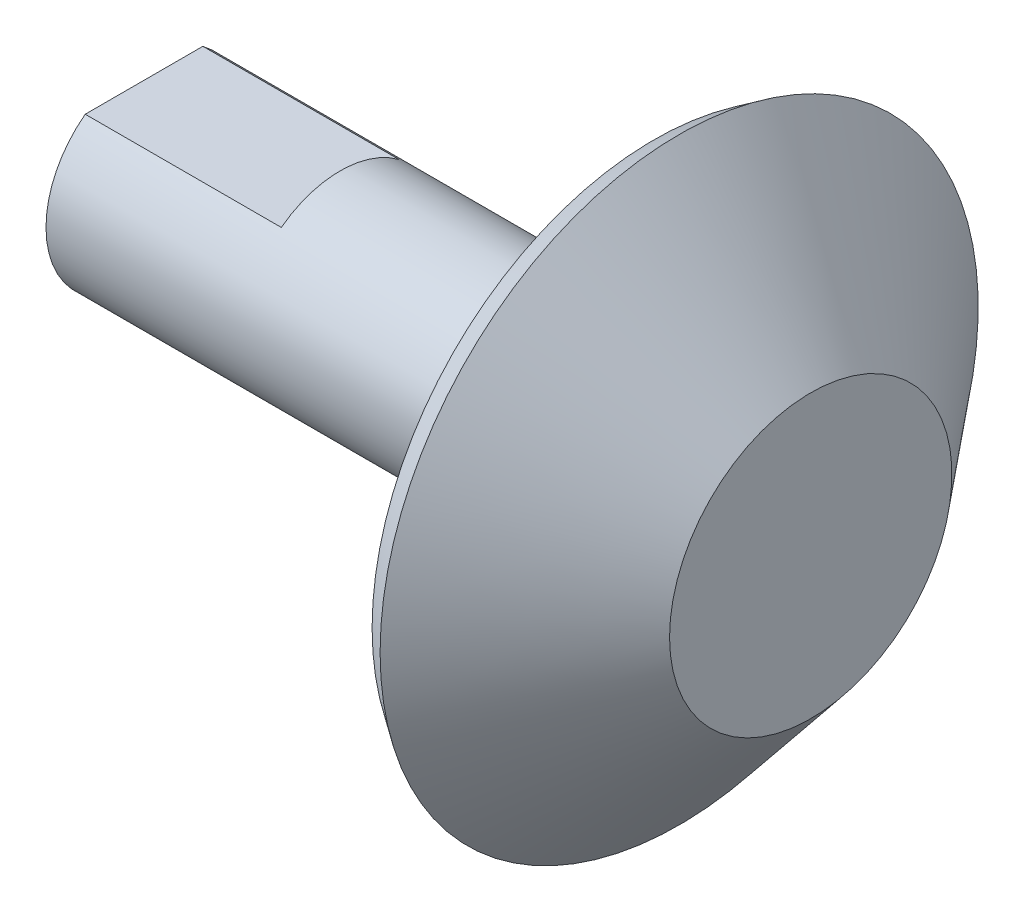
from build123d import *

# Parameters (mm, degrees)
ESQUISSE5_W             = 6.403947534
ESQUISSE5_H             = 1.660282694
ENL_V_MAT_EXTRU_2_DEPTH = 5


with BuildPart() as part:
    # Esquisse4 → Base-R_volution (revolve)
    with BuildSketch(Plane.XY, mode=Mode.PRIVATE) as base_r_volution_sk:
        Polygon((-7, 0), (-3, 0), (-3, 3.6), (-6.35498482, 7.625981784), (-7, 7.184683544), (-7, 2.5), (-20, 2.5), (-20, 0), align=None)
    revolve(base_r_volution_sk.sketch.rotate(Axis((-8.669115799, 0, 0), (1, 0, 0)), 90), axis=Axis((-8.669115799, 0, 0), (1, 0, 0)))

    # Esquisse5 → Enl_v. mat.-Extru.2 (cut)
    with BuildSketch(Plane.ZY.offset(20)):
        with Locations((-0.088943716, 2.830141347)):
            Rectangle(ESQUISSE5_W, ESQUISSE5_H)
    extrude(amount=-ENL_V_MAT_EXTRU_2_DEPTH, mode=Mode.SUBTRACT)


solid = part.part
